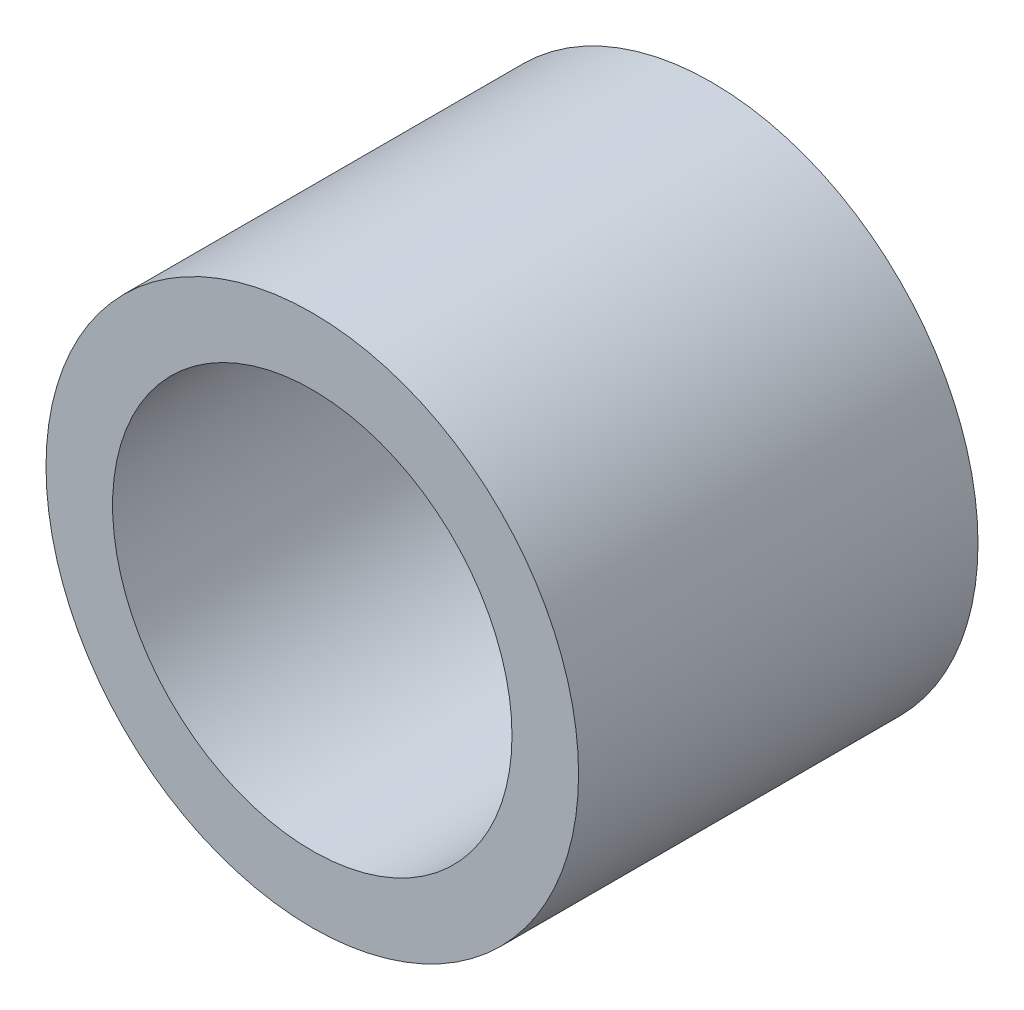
ISO-10303-21;
HEADER;
FILE_DESCRIPTION(('STEP AP214'),'2;1');
FILE_NAME('part.step','',(''),(''),'','','');
FILE_SCHEMA(('AUTOMOTIVE_DESIGN { 1 0 10303 214 1 1 1 1 }'));
ENDSEC;
DATA;
#1=APPLICATION_CONTEXT('core data for automotive mechanical design processes');
#2=APPLICATION_PROTOCOL_DEFINITION('international standard','automotive_design',2000,#1);
#3=PRODUCT_CONTEXT('',#1,'mechanical');
#4=PRODUCT('Part','Part','',(#3));
#5=PRODUCT_RELATED_PRODUCT_CATEGORY('part','',(#4));
#6=PRODUCT_DEFINITION_FORMATION('','',#4);
#7=PRODUCT_DEFINITION_CONTEXT('part definition',#1,'design');
#8=PRODUCT_DEFINITION('design','',#6,#7);
#9=PRODUCT_DEFINITION_SHAPE('','',#8);
#10=(LENGTH_UNIT() NAMED_UNIT(*) SI_UNIT(.MILLI.,.METRE.));
#11=(NAMED_UNIT(*) PLANE_ANGLE_UNIT() SI_UNIT($,.RADIAN.));
#12=(NAMED_UNIT(*) SI_UNIT($,.STERADIAN.) SOLID_ANGLE_UNIT());
#13=UNCERTAINTY_MEASURE_WITH_UNIT(LENGTH_MEASURE(1.E-05),#10,'distance_accuracy_value','');
#14=(GEOMETRIC_REPRESENTATION_CONTEXT(3) GLOBAL_UNCERTAINTY_ASSIGNED_CONTEXT((#13)) GLOBAL_UNIT_ASSIGNED_CONTEXT((#10,
#11,#12)) REPRESENTATION_CONTEXT('',''));
#15=CARTESIAN_POINT('',(0.,0.,0.));
#16=DIRECTION('',(0.,0.,1.));
#17=DIRECTION('',(1.,0.,0.));
#18=AXIS2_PLACEMENT_3D('',#15,#16,#17);
#19=CARTESIAN_POINT('',(0.,0.,30.));
#20=DIRECTION('',(0.,0.,1.));
#21=DIRECTION('',(1.,0.,0.));
#22=AXIS2_PLACEMENT_3D('',#19,#20,#21);
#23=PLANE('',#22);
#24=CARTESIAN_POINT('',(0.,0.,30.));
#25=DIRECTION('',(0.,0.,1.));
#26=DIRECTION('',(1.,0.,0.));
#27=AXIS2_PLACEMENT_3D('',#24,#25,#26);
#28=CIRCLE('',#27,20.);
#29=CARTESIAN_POINT('',(20.,0.,30.));
#30=VERTEX_POINT('',#29);
#31=EDGE_CURVE('E10',#30,#30,#28,.T.);
#32=ORIENTED_EDGE('',*,*,#31,.T.);
#33=EDGE_LOOP('',(#32));
#34=FACE_BOUND('',#33,.T.);
#35=CARTESIAN_POINT('',(0.,0.,30.));
#36=DIRECTION('',(0.,0.,1.));
#37=DIRECTION('',(1.,0.,0.));
#38=AXIS2_PLACEMENT_3D('',#35,#36,#37);
#39=CIRCLE('',#38,15.);
#40=CARTESIAN_POINT('',(15.,0.,30.));
#41=VERTEX_POINT('',#40);
#42=EDGE_CURVE('E48',#41,#41,#39,.T.);
#43=ORIENTED_EDGE('',*,*,#42,.F.);
#44=EDGE_LOOP('',(#43));
#45=FACE_BOUND('',#44,.T.);
#46=ADVANCED_FACE('F37',(#34,#45),#23,.T.);
#47=CARTESIAN_POINT('',(0.,0.,0.));
#48=DIRECTION('',(0.,0.,1.));
#49=DIRECTION('',(1.,0.,0.));
#50=AXIS2_PLACEMENT_3D('',#47,#48,#49);
#51=PLANE('',#50);
#52=CARTESIAN_POINT('',(0.,0.,0.));
#53=DIRECTION('',(0.,0.,1.));
#54=DIRECTION('',(1.,0.,0.));
#55=AXIS2_PLACEMENT_3D('',#52,#53,#54);
#56=CIRCLE('',#55,20.);
#57=CARTESIAN_POINT('',(20.,0.,0.));
#58=VERTEX_POINT('',#57);
#59=EDGE_CURVE('E41',#58,#58,#56,.T.);
#60=ORIENTED_EDGE('',*,*,#59,.F.);
#61=EDGE_LOOP('',(#60));
#62=FACE_BOUND('',#61,.T.);
#63=CARTESIAN_POINT('',(0.,0.,0.));
#64=DIRECTION('',(0.,0.,1.));
#65=DIRECTION('',(1.,0.,0.));
#66=AXIS2_PLACEMENT_3D('',#63,#64,#65);
#67=CIRCLE('',#66,15.);
#68=CARTESIAN_POINT('',(15.,0.,0.));
#69=VERTEX_POINT('',#68);
#70=EDGE_CURVE('E50',#69,#69,#67,.T.);
#71=ORIENTED_EDGE('',*,*,#70,.T.);
#72=EDGE_LOOP('',(#71));
#73=FACE_BOUND('',#72,.T.);
#74=ADVANCED_FACE('F60',(#62,#73),#51,.F.);
#75=CARTESIAN_POINT('',(0.,0.,30.));
#76=DIRECTION('',(0.,0.,-1.));
#77=DIRECTION('',(-1.,0.,0.));
#78=AXIS2_PLACEMENT_3D('',#75,#76,#77);
#79=CYLINDRICAL_SURFACE('',#78,20.);
#80=ORIENTED_EDGE('',*,*,#31,.F.);
#81=EDGE_LOOP('',(#80));
#82=FACE_BOUND('',#81,.T.);
#83=ORIENTED_EDGE('',*,*,#59,.T.);
#84=EDGE_LOOP('',(#83));
#85=FACE_BOUND('',#84,.T.);
#86=ADVANCED_FACE('F39',(#82,#85),#79,.T.);
#87=CARTESIAN_POINT('',(0.,0.,30.));
#88=DIRECTION('',(0.,0.,-1.));
#89=DIRECTION('',(-1.,0.,0.));
#90=AXIS2_PLACEMENT_3D('',#87,#88,#89);
#91=CYLINDRICAL_SURFACE('',#90,15.);
#92=ORIENTED_EDGE('',*,*,#42,.T.);
#93=EDGE_LOOP('',(#92));
#94=FACE_BOUND('',#93,.T.);
#95=ORIENTED_EDGE('',*,*,#70,.F.);
#96=EDGE_LOOP('',(#95));
#97=FACE_BOUND('',#96,.T.);
#98=ADVANCED_FACE('F56',(#94,#97),#91,.F.);
#99=CLOSED_SHELL('',(#46,#74,#86,#98));
#100=MANIFOLD_SOLID_BREP('B2',#99);
#101=ADVANCED_BREP_SHAPE_REPRESENTATION('',(#18,#100),#14);
#102=SHAPE_DEFINITION_REPRESENTATION(#9,#101);
ENDSEC;
END-ISO-10303-21;
